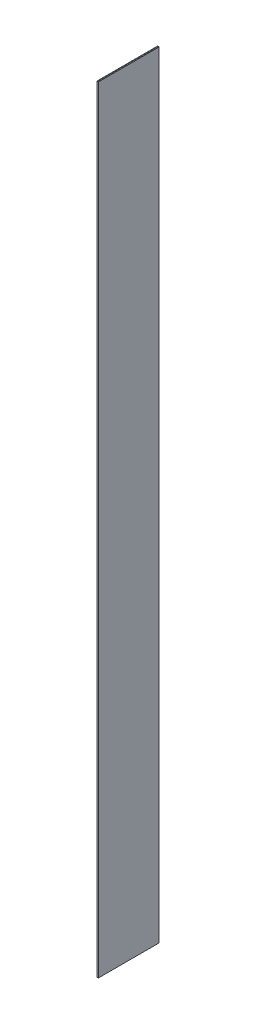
from build123d import *

# Parameters (mm, degrees)
SKETCH1_W           = 19.05
SKETCH1_H           = 762
BOSS_EXTRUDE1_DEPTH = 9739.6
CHAMFER2_SIZE       = 6


with BuildPart() as part:
    # Sketch1 → Boss-Extrude1 (new body)
    with BuildSketch(Plane(origin=(0, 0, 0), x_dir=(-1, 0, 0), z_dir=(0, 1, 0))):
        Rectangle(SKETCH1_W, SKETCH1_H)
    extrude(amount=BOSS_EXTRUDE1_DEPTH)

    # Chamfer2
    chamfer2_edges = [part.edges().sort_by_distance(p)[0] for p in [
        (9.525, 9739.6, 0),
        (0, 9739.6, -381),
        (-9.525, 9739.6, 0),
        (0, 0, -381),
        (9.525, 0, 0),
        (0, 0, 381),
        (-9.525, 0, 0),
        (0, 9739.6, 381),
    ]]
    chamfer(chamfer2_edges, length=CHAMFER2_SIZE)


solid = part.part
